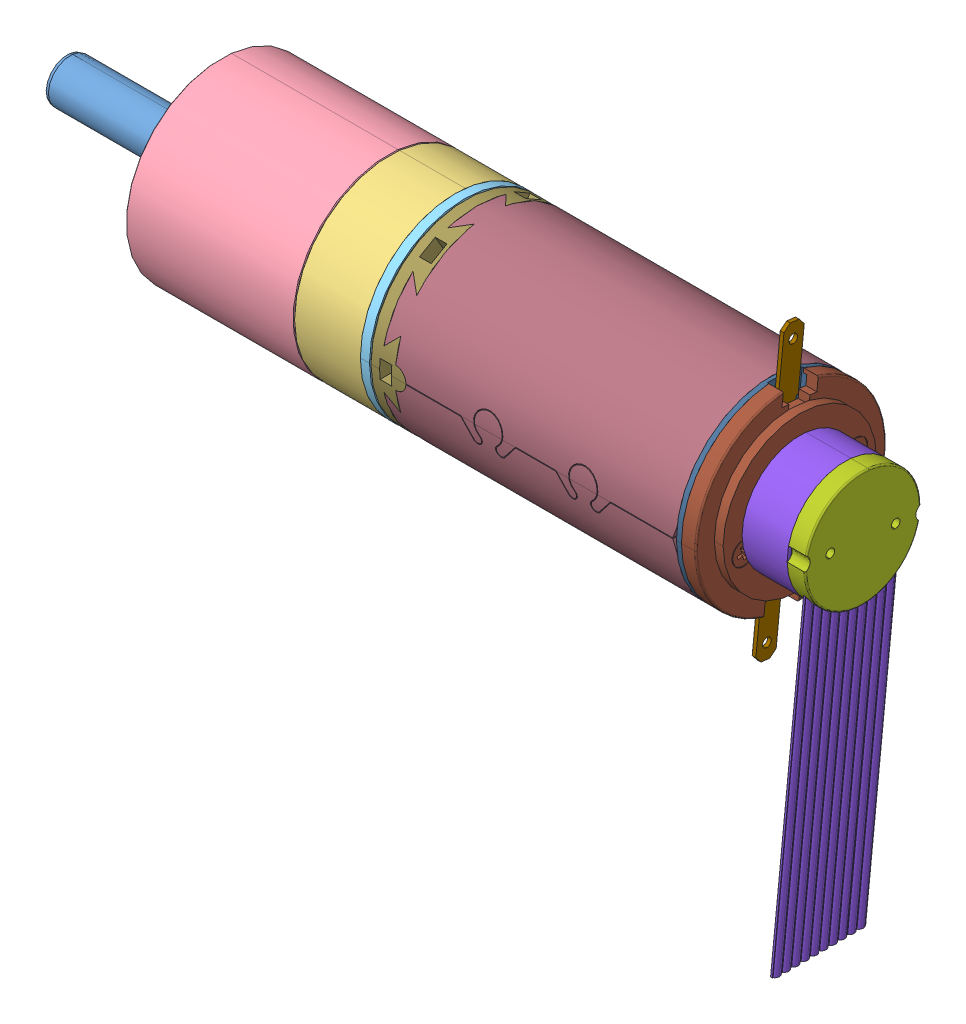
SolidWorks assembly DC-MAX26S_GPX26_ENX16.sldasm, configuration Default (file format 13000). Lengths in mm.
Overall size (108.9 66.13 26.01).
13 component instances, 13 part files, 0 mates.
Components (placement in the parent):
- GPX26_1-1: GPX26_1.sldprt [Default] at origin size (22 6 6)
- GPX26_2-1: GPX26_2.SLDPRT [Default] at origin size (5 15 15)
- GPX26_3-1: GPX26_3.SLDPRT [Default] at origin size (9.1 26 26)
- GPX26_4-1: GPX26_4.SLDPRT [Default] at origin size (23 26 26)
- GPX26_5-2: GPX26_5.SLDPRT [Default] at origin size (3.05 26 26)
- ENX16_1-1: ENX16_1.SLDPRT [Default] at origin size (0.5 14.8 14.8)
- ENX16_2-1: ENX16_2.SLDPRT [Default] at origin size (2.48 15.8 15.8)
- ENX16_3-1: ENX16_3.SLDPRT [Default] at origin size (7.9 54.87 19.22)
- DC-MAX26S_3-1: DC-MAX26S_3.SLDPRT [Default] at origin size (0.5 38.32 6.63)
- DC-MAX26S_4-1: DC-MAX26S_4.SLDPRT [Default] at origin size (8.9 26 26)
- DC-MAX26S_5-1: DC-MAX26S_5.SLDPRT [Default] at origin size (3.2 25.92 26)
- DC-MAX26S_1-3: DC-MAX26S_1.SLDPRT [Default] at origin size (15.75 26 26.01)
- DC-MAX26S_6-1: DC-MAX26S_6.SLDPRT [Default] at origin size (40.3 26 26.01)
